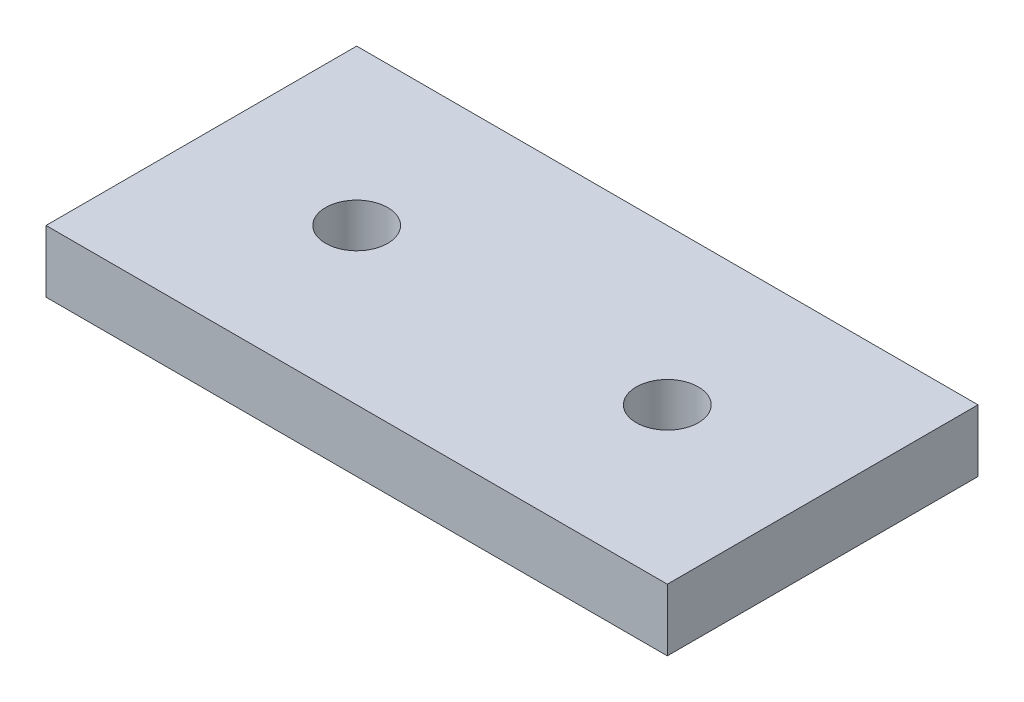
ISO-10303-21;
HEADER;
FILE_DESCRIPTION(('STEP AP214'),'2;1');
FILE_NAME('part.step','',(''),(''),'','','');
FILE_SCHEMA(('AUTOMOTIVE_DESIGN { 1 0 10303 214 1 1 1 1 }'));
ENDSEC;
DATA;
#1=APPLICATION_CONTEXT('core data for automotive mechanical design processes');
#2=APPLICATION_PROTOCOL_DEFINITION('international standard','automotive_design',2000,#1);
#3=PRODUCT_CONTEXT('',#1,'mechanical');
#4=PRODUCT('Part','Part','',(#3));
#5=PRODUCT_RELATED_PRODUCT_CATEGORY('part','',(#4));
#6=PRODUCT_DEFINITION_FORMATION('','',#4);
#7=PRODUCT_DEFINITION_CONTEXT('part definition',#1,'design');
#8=PRODUCT_DEFINITION('design','',#6,#7);
#9=PRODUCT_DEFINITION_SHAPE('','',#8);
#10=(LENGTH_UNIT() NAMED_UNIT(*) SI_UNIT(.MILLI.,.METRE.));
#11=(NAMED_UNIT(*) PLANE_ANGLE_UNIT() SI_UNIT($,.RADIAN.));
#12=(NAMED_UNIT(*) SI_UNIT($,.STERADIAN.) SOLID_ANGLE_UNIT());
#13=UNCERTAINTY_MEASURE_WITH_UNIT(LENGTH_MEASURE(1.E-05),#10,'distance_accuracy_value','');
#14=(GEOMETRIC_REPRESENTATION_CONTEXT(3) GLOBAL_UNCERTAINTY_ASSIGNED_CONTEXT((#13)) GLOBAL_UNIT_ASSIGNED_CONTEXT((#10,
#11,#12)) REPRESENTATION_CONTEXT('',''));
#15=CARTESIAN_POINT('',(0.,0.,0.));
#16=DIRECTION('',(0.,0.,1.));
#17=DIRECTION('',(1.,0.,0.));
#18=AXIS2_PLACEMENT_3D('',#15,#16,#17);
#19=CARTESIAN_POINT('',(50.,10.,-25.));
#20=DIRECTION('',(-1.,0.,0.));
#21=DIRECTION('',(0.,0.,1.));
#22=AXIS2_PLACEMENT_3D('',#19,#20,#21);
#23=PLANE('',#22);
#24=DIRECTION('',(0.,0.,-1.));
#25=VECTOR('',#24,1.);
#26=CARTESIAN_POINT('',(50.,0.,-25.));
#27=LINE('',#26,#25);
#28=CARTESIAN_POINT('',(50.,0.,25.));
#29=VERTEX_POINT('',#28);
#30=CARTESIAN_POINT('',(50.,0.,-25.));
#31=VERTEX_POINT('',#30);
#32=EDGE_CURVE('E97',#29,#31,#27,.T.);
#33=ORIENTED_EDGE('',*,*,#32,.T.);
#34=DIRECTION('',(0.,-1.,0.));
#35=VECTOR('',#34,1.);
#36=CARTESIAN_POINT('',(50.,10.,-25.));
#37=LINE('',#36,#35);
#38=CARTESIAN_POINT('',(50.,10.,-25.));
#39=VERTEX_POINT('',#38);
#40=EDGE_CURVE('E11',#39,#31,#37,.T.);
#41=ORIENTED_EDGE('',*,*,#40,.F.);
#42=DIRECTION('',(0.,0.,-1.));
#43=VECTOR('',#42,1.);
#44=CARTESIAN_POINT('',(50.,10.,-25.));
#45=LINE('',#44,#43);
#46=CARTESIAN_POINT('',(50.,10.,25.));
#47=VERTEX_POINT('',#46);
#48=EDGE_CURVE('E85',#47,#39,#45,.T.);
#49=ORIENTED_EDGE('',*,*,#48,.F.);
#50=DIRECTION('',(0.,-1.,0.));
#51=VECTOR('',#50,1.);
#52=CARTESIAN_POINT('',(50.,10.,25.));
#53=LINE('',#52,#51);
#54=EDGE_CURVE('E93',#47,#29,#53,.T.);
#55=ORIENTED_EDGE('',*,*,#54,.T.);
#56=EDGE_LOOP('',(#33,#41,#49,#55));
#57=FACE_BOUND('',#56,.T.);
#58=ADVANCED_FACE('F34',(#57),#23,.F.);
#59=CARTESIAN_POINT('',(-50.,10.,-25.));
#60=DIRECTION('',(0.,0.,1.));
#61=DIRECTION('',(1.,0.,0.));
#62=AXIS2_PLACEMENT_3D('',#59,#60,#61);
#63=PLANE('',#62);
#64=DIRECTION('',(-1.,0.,0.));
#65=VECTOR('',#64,1.);
#66=CARTESIAN_POINT('',(-50.,0.,-25.));
#67=LINE('',#66,#65);
#68=CARTESIAN_POINT('',(-50.,0.,-25.));
#69=VERTEX_POINT('',#68);
#70=EDGE_CURVE('E89',#31,#69,#67,.T.);
#71=ORIENTED_EDGE('',*,*,#70,.T.);
#72=DIRECTION('',(0.,-1.,0.));
#73=VECTOR('',#72,1.);
#74=CARTESIAN_POINT('',(-50.,10.,-25.));
#75=LINE('',#74,#73);
#76=CARTESIAN_POINT('',(-50.,10.,-25.));
#77=VERTEX_POINT('',#76);
#78=EDGE_CURVE('E42',#77,#69,#75,.T.);
#79=ORIENTED_EDGE('',*,*,#78,.F.);
#80=DIRECTION('',(-1.,0.,0.));
#81=VECTOR('',#80,1.);
#82=CARTESIAN_POINT('',(-50.,10.,-25.));
#83=LINE('',#82,#81);
#84=EDGE_CURVE('E80',#39,#77,#83,.T.);
#85=ORIENTED_EDGE('',*,*,#84,.F.);
#86=ORIENTED_EDGE('',*,*,#40,.T.);
#87=EDGE_LOOP('',(#71,#79,#85,#86));
#88=FACE_BOUND('',#87,.T.);
#89=ADVANCED_FACE('F88',(#88),#63,.F.);
#90=CARTESIAN_POINT('',(-50.,10.,-25.));
#91=DIRECTION('',(1.,0.,0.));
#92=DIRECTION('',(0.,0.,-1.));
#93=AXIS2_PLACEMENT_3D('',#90,#91,#92);
#94=PLANE('',#93);
#95=DIRECTION('',(0.,0.,1.));
#96=VECTOR('',#95,1.);
#97=CARTESIAN_POINT('',(-50.,0.,-25.));
#98=LINE('',#97,#96);
#99=CARTESIAN_POINT('',(-50.,0.,25.));
#100=VERTEX_POINT('',#99);
#101=EDGE_CURVE('E67',#69,#100,#98,.T.);
#102=ORIENTED_EDGE('',*,*,#101,.T.);
#103=DIRECTION('',(0.,-1.,0.));
#104=VECTOR('',#103,1.);
#105=CARTESIAN_POINT('',(-50.,10.,25.));
#106=LINE('',#105,#104);
#107=CARTESIAN_POINT('',(-50.,10.,25.));
#108=VERTEX_POINT('',#107);
#109=EDGE_CURVE('E90',#108,#100,#106,.T.);
#110=ORIENTED_EDGE('',*,*,#109,.F.);
#111=DIRECTION('',(0.,0.,1.));
#112=VECTOR('',#111,1.);
#113=CARTESIAN_POINT('',(-50.,10.,-25.));
#114=LINE('',#113,#112);
#115=EDGE_CURVE('E83',#77,#108,#114,.T.);
#116=ORIENTED_EDGE('',*,*,#115,.F.);
#117=ORIENTED_EDGE('',*,*,#78,.T.);
#118=EDGE_LOOP('',(#102,#110,#116,#117));
#119=FACE_BOUND('',#118,.T.);
#120=ADVANCED_FACE('F91',(#119),#94,.F.);
#121=CARTESIAN_POINT('',(-50.,10.,25.));
#122=DIRECTION('',(0.,0.,-1.));
#123=DIRECTION('',(-1.,0.,0.));
#124=AXIS2_PLACEMENT_3D('',#121,#122,#123);
#125=PLANE('',#124);
#126=DIRECTION('',(1.,0.,0.));
#127=VECTOR('',#126,1.);
#128=CARTESIAN_POINT('',(-50.,0.,25.));
#129=LINE('',#128,#127);
#130=EDGE_CURVE('E73',#100,#29,#129,.T.);
#131=ORIENTED_EDGE('',*,*,#130,.T.);
#132=ORIENTED_EDGE('',*,*,#54,.F.);
#133=DIRECTION('',(1.,0.,0.));
#134=VECTOR('',#133,1.);
#135=CARTESIAN_POINT('',(-50.,10.,25.));
#136=LINE('',#135,#134);
#137=EDGE_CURVE('E50',#108,#47,#136,.T.);
#138=ORIENTED_EDGE('',*,*,#137,.F.);
#139=ORIENTED_EDGE('',*,*,#109,.T.);
#140=EDGE_LOOP('',(#131,#132,#138,#139));
#141=FACE_BOUND('',#140,.T.);
#142=ADVANCED_FACE('F105',(#141),#125,.F.);
#143=CARTESIAN_POINT('',(0.,10.,0.));
#144=DIRECTION('',(0.,1.,0.));
#145=DIRECTION('',(0.,0.,1.));
#146=AXIS2_PLACEMENT_3D('',#143,#144,#145);
#147=PLANE('',#146);
#148=CARTESIAN_POINT('',(-25.,10.,0.));
#149=DIRECTION('',(0.,1.,0.));
#150=DIRECTION('',(0.,0.,1.));
#151=AXIS2_PLACEMENT_3D('',#148,#149,#150);
#152=CIRCLE('',#151,5.);
#153=CARTESIAN_POINT('',(-25.,10.,5.));
#154=VERTEX_POINT('',#153);
#155=EDGE_CURVE('E117',#154,#154,#152,.T.);
#156=ORIENTED_EDGE('',*,*,#155,.F.);
#157=EDGE_LOOP('',(#156));
#158=FACE_BOUND('',#157,.T.);
#159=CARTESIAN_POINT('',(25.,10.,0.));
#160=DIRECTION('',(0.,1.,0.));
#161=DIRECTION('',(0.,0.,-1.));
#162=AXIS2_PLACEMENT_3D('',#159,#160,#161);
#163=CIRCLE('',#162,5.);
#164=CARTESIAN_POINT('',(25.,10.,-5.));
#165=VERTEX_POINT('',#164);
#166=EDGE_CURVE('E111',#165,#165,#163,.T.);
#167=ORIENTED_EDGE('',*,*,#166,.F.);
#168=EDGE_LOOP('',(#167));
#169=FACE_BOUND('',#168,.T.);
#170=ORIENTED_EDGE('',*,*,#48,.T.);
#171=ORIENTED_EDGE('',*,*,#84,.T.);
#172=ORIENTED_EDGE('',*,*,#115,.T.);
#173=ORIENTED_EDGE('',*,*,#137,.T.);
#174=EDGE_LOOP('',(#170,#171,#172,#173));
#175=FACE_BOUND('',#174,.T.);
#176=ADVANCED_FACE('F81',(#158,#169,#175),#147,.T.);
#177=CARTESIAN_POINT('',(0.,0.,0.));
#178=DIRECTION('',(0.,1.,0.));
#179=DIRECTION('',(0.,0.,1.));
#180=AXIS2_PLACEMENT_3D('',#177,#178,#179);
#181=PLANE('',#180);
#182=CARTESIAN_POINT('',(-25.,0.,0.));
#183=DIRECTION('',(0.,1.,0.));
#184=DIRECTION('',(0.,0.,1.));
#185=AXIS2_PLACEMENT_3D('',#182,#183,#184);
#186=CIRCLE('',#185,5.);
#187=CARTESIAN_POINT('',(-25.,0.,5.));
#188=VERTEX_POINT('',#187);
#189=EDGE_CURVE('E100',#188,#188,#186,.T.);
#190=ORIENTED_EDGE('',*,*,#189,.T.);
#191=EDGE_LOOP('',(#190));
#192=FACE_BOUND('',#191,.T.);
#193=CARTESIAN_POINT('',(25.,0.,0.));
#194=DIRECTION('',(0.,1.,0.));
#195=DIRECTION('',(0.,0.,-1.));
#196=AXIS2_PLACEMENT_3D('',#193,#194,#195);
#197=CIRCLE('',#196,5.);
#198=CARTESIAN_POINT('',(25.,0.,-5.));
#199=VERTEX_POINT('',#198);
#200=EDGE_CURVE('E114',#199,#199,#197,.T.);
#201=ORIENTED_EDGE('',*,*,#200,.T.);
#202=EDGE_LOOP('',(#201));
#203=FACE_BOUND('',#202,.T.);
#204=ORIENTED_EDGE('',*,*,#32,.F.);
#205=ORIENTED_EDGE('',*,*,#130,.F.);
#206=ORIENTED_EDGE('',*,*,#101,.F.);
#207=ORIENTED_EDGE('',*,*,#70,.F.);
#208=EDGE_LOOP('',(#204,#205,#206,#207));
#209=FACE_BOUND('',#208,.T.);
#210=ADVANCED_FACE('F108',(#192,#203,#209),#181,.F.);
#211=CARTESIAN_POINT('',(25.,0.,0.));
#212=DIRECTION('',(0.,1.,0.));
#213=DIRECTION('',(0.,0.,1.));
#214=AXIS2_PLACEMENT_3D('',#211,#212,#213);
#215=CYLINDRICAL_SURFACE('',#214,5.);
#216=ORIENTED_EDGE('',*,*,#200,.F.);
#217=EDGE_LOOP('',(#216));
#218=FACE_BOUND('',#217,.T.);
#219=ORIENTED_EDGE('',*,*,#166,.T.);
#220=EDGE_LOOP('',(#219));
#221=FACE_BOUND('',#220,.T.);
#222=ADVANCED_FACE('F128',(#218,#221),#215,.F.);
#223=CARTESIAN_POINT('',(-25.,0.,0.));
#224=DIRECTION('',(0.,1.,0.));
#225=DIRECTION('',(0.,0.,1.));
#226=AXIS2_PLACEMENT_3D('',#223,#224,#225);
#227=CYLINDRICAL_SURFACE('',#226,5.);
#228=ORIENTED_EDGE('',*,*,#189,.F.);
#229=EDGE_LOOP('',(#228));
#230=FACE_BOUND('',#229,.T.);
#231=ORIENTED_EDGE('',*,*,#155,.T.);
#232=EDGE_LOOP('',(#231));
#233=FACE_BOUND('',#232,.T.);
#234=ADVANCED_FACE('F125',(#230,#233),#227,.F.);
#235=CLOSED_SHELL('',(#58,#89,#120,#142,#176,#210,#222,#234));
#236=MANIFOLD_SOLID_BREP('B2',#235);
#237=ADVANCED_BREP_SHAPE_REPRESENTATION('',(#18,#236),#14);
#238=SHAPE_DEFINITION_REPRESENTATION(#9,#237);
ENDSEC;
END-ISO-10303-21;
